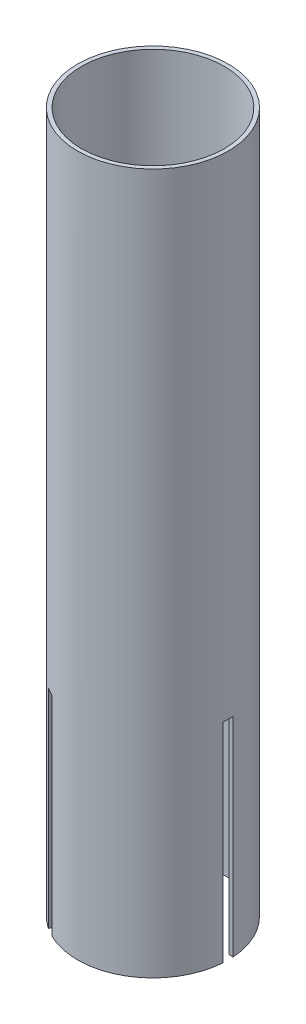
from build123d import *

# Parameters (mm, degrees)
SKETCH2_R           = 28.702
SKETCH2_R_2         = 27.178
EXTRUDE_THIN1_DEPTH = 266.7
CUT_EXTRUDE1_DEPTH  = 79.375
CIRPATTERN1_COUNT   = 3


with BuildPart() as part:
    # Sketch2 → Extrude-Thin1 (new body)
    with BuildSketch(Plane(origin=(0, 0, 0), x_dir=(1, 0, 0), z_dir=(0, 1, 0))):
        Circle(SKETCH2_R)
        Circle(SKETCH2_R_2, mode=Mode.SUBTRACT)
    extrude(amount=EXTRUDE_THIN1_DEPTH)

    # Sketch3 → Cut-Extrude1 (cut)
    with BuildSketch(Plane.XZ):
        Polygon((0, 0), (0, -1.905), (31.539611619, -1.905), (31.539611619, 1.905), (0, 1.905), align=None)
    cut_extrude1 = extrude(amount=-CUT_EXTRUDE1_DEPTH, mode=Mode.SUBTRACT)

    # CirPattern1: Cut-Extrude1 ×3 about axis
    cirpattern1_axis = Axis((0, 0, 0), (0, 1, 0))
    for i in range(1, CIRPATTERN1_COUNT):
        add(cut_extrude1.rotate(cirpattern1_axis, i * 360 / CIRPATTERN1_COUNT), mode=Mode.SUBTRACT)


solid = part.part
